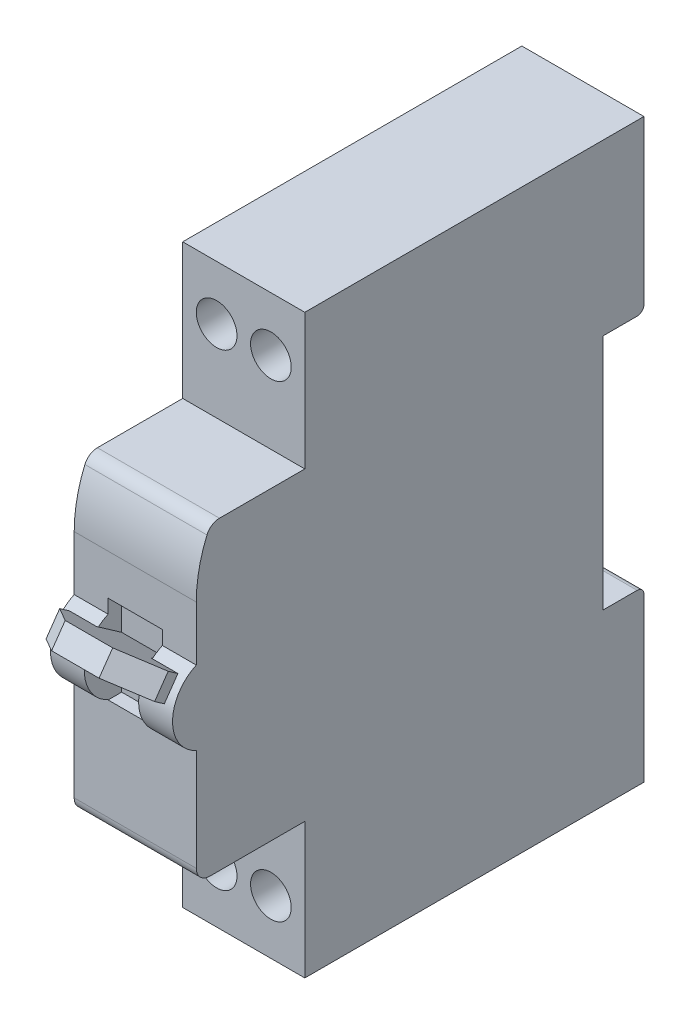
ISO-10303-21;
HEADER;
FILE_DESCRIPTION(('STEP AP214'),'2;1');
FILE_NAME('part.step','',(''),(''),'','','');
FILE_SCHEMA(('AUTOMOTIVE_DESIGN { 1 0 10303 214 1 1 1 1 }'));
ENDSEC;
DATA;
#1=APPLICATION_CONTEXT('core data for automotive mechanical design processes');
#2=APPLICATION_PROTOCOL_DEFINITION('international standard','automotive_design',2000,#1);
#3=PRODUCT_CONTEXT('',#1,'mechanical');
#4=PRODUCT('Part','Part','',(#3));
#5=PRODUCT_RELATED_PRODUCT_CATEGORY('part','',(#4));
#6=PRODUCT_DEFINITION_FORMATION('','',#4);
#7=PRODUCT_DEFINITION_CONTEXT('part definition',#1,'design');
#8=PRODUCT_DEFINITION('design','',#6,#7);
#9=PRODUCT_DEFINITION_SHAPE('','',#8);
#10=(LENGTH_UNIT() NAMED_UNIT(*) SI_UNIT(.MILLI.,.METRE.));
#11=(NAMED_UNIT(*) PLANE_ANGLE_UNIT() SI_UNIT($,.RADIAN.));
#12=(NAMED_UNIT(*) SI_UNIT($,.STERADIAN.) SOLID_ANGLE_UNIT());
#13=UNCERTAINTY_MEASURE_WITH_UNIT(LENGTH_MEASURE(1.E-05),#10,'distance_accuracy_value','');
#14=(GEOMETRIC_REPRESENTATION_CONTEXT(3) GLOBAL_UNCERTAINTY_ASSIGNED_CONTEXT((#13)) GLOBAL_UNIT_ASSIGNED_CONTEXT((#10,
#11,#12)) REPRESENTATION_CONTEXT('',''));
#15=CARTESIAN_POINT('',(0.,0.,0.));
#16=DIRECTION('',(0.,0.,1.));
#17=DIRECTION('',(1.,0.,0.));
#18=AXIS2_PLACEMENT_3D('',#15,#16,#17);
#19=CARTESIAN_POINT('',(-13.,1.,63.));
#20=DIRECTION('',(-1.,0.,0.));
#21=DIRECTION('',(0.,0.,1.));
#22=AXIS2_PLACEMENT_3D('',#19,#20,#21);
#23=PLANE('',#22);
#24=DIRECTION('',(0.,-0.573576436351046,-0.819152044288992));
#25=VECTOR('',#24,1.);
#26=CARTESIAN_POINT('',(-13.,1.86454843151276,63.713883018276));
#27=LINE('',#26,#25);
#28=CARTESIAN_POINT('',(-13.,1.56866142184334,63.2913125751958));
#29=VERTEX_POINT('',#28);
#30=CARTESIAN_POINT('',(-13.,-2.13635553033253,58.));
#31=VERTEX_POINT('',#30);
#32=EDGE_CURVE('E337',#29,#31,#27,.T.);
#33=ORIENTED_EDGE('',*,*,#32,.F.);
#34=CARTESIAN_POINT('',(-13.,0.,57.5));
#35=DIRECTION('',(-1.,0.,0.));
#36=DIRECTION('',(0.,0.,1.));
#37=AXIS2_PLACEMENT_3D('',#34,#35,#36);
#38=CIRCLE('',#37,6.);
#39=CARTESIAN_POINT('',(-13.,-5.45435605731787,60.));
#40=VERTEX_POINT('',#39);
#41=EDGE_CURVE('E419',#40,#29,#38,.T.);
#42=ORIENTED_EDGE('',*,*,#41,.F.);
#43=DIRECTION('',(0.,-1.,0.));
#44=VECTOR('',#43,1.);
#45=CARTESIAN_POINT('',(-13.,-5.45435605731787,60.));
#46=LINE('',#45,#44);
#47=CARTESIAN_POINT('',(-13.,-5.50000000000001,60.));
#48=VERTEX_POINT('',#47);
#49=EDGE_CURVE('E423',#40,#48,#46,.T.);
#50=ORIENTED_EDGE('',*,*,#49,.T.);
#51=DIRECTION('',(0.,0.,-1.));
#52=VECTOR('',#51,1.);
#53=CARTESIAN_POINT('',(-13.,-5.50000000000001,63.));
#54=LINE('',#53,#52);
#55=CARTESIAN_POINT('',(-13.,-5.50000000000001,58.));
#56=VERTEX_POINT('',#55);
#57=EDGE_CURVE('E407',#48,#56,#54,.T.);
#58=ORIENTED_EDGE('',*,*,#57,.T.);
#59=DIRECTION('',(0.,1.,0.));
#60=VECTOR('',#59,1.);
#61=CARTESIAN_POINT('',(-13.,1.,58.));
#62=LINE('',#61,#60);
#63=EDGE_CURVE('E403',#56,#31,#62,.T.);
#64=ORIENTED_EDGE('',*,*,#63,.T.);
#65=EDGE_LOOP('',(#33,#42,#50,#58,#64));
#66=FACE_BOUND('',#65,.T.);
#67=ADVANCED_FACE('F16',(#66),#23,.F.);
#68=CARTESIAN_POINT('',(-5.,1.,58.));
#69=DIRECTION('',(0.,0.,-1.));
#70=DIRECTION('',(-1.,0.,0.));
#71=AXIS2_PLACEMENT_3D('',#68,#69,#70);
#72=PLANE('',#71);
#73=DIRECTION('',(1.,0.,0.));
#74=VECTOR('',#73,1.);
#75=CARTESIAN_POINT('',(-5.,-2.13635553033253,58.));
#76=LINE('',#75,#74);
#77=CARTESIAN_POINT('',(-5.,-2.13635553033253,58.));
#78=VERTEX_POINT('',#77);
#79=EDGE_CURVE('E372',#31,#78,#76,.T.);
#80=ORIENTED_EDGE('',*,*,#79,.F.);
#81=ORIENTED_EDGE('',*,*,#63,.F.);
#82=DIRECTION('',(-1.,0.,0.));
#83=VECTOR('',#82,1.);
#84=CARTESIAN_POINT('',(-5.,-5.50000000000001,58.));
#85=LINE('',#84,#83);
#86=CARTESIAN_POINT('',(-5.,-5.50000000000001,58.));
#87=VERTEX_POINT('',#86);
#88=EDGE_CURVE('E394',#87,#56,#85,.T.);
#89=ORIENTED_EDGE('',*,*,#88,.F.);
#90=DIRECTION('',(0.,-1.,0.));
#91=VECTOR('',#90,1.);
#92=CARTESIAN_POINT('',(-5.,1.,58.));
#93=LINE('',#92,#91);
#94=EDGE_CURVE('E382',#78,#87,#93,.T.);
#95=ORIENTED_EDGE('',*,*,#94,.F.);
#96=EDGE_LOOP('',(#80,#81,#89,#95));
#97=FACE_BOUND('',#96,.T.);
#98=ADVANCED_FACE('F692',(#97),#72,.F.);
#99=CARTESIAN_POINT('',(-5.,1.,63.));
#100=DIRECTION('',(1.,0.,0.));
#101=DIRECTION('',(0.,0.,-1.));
#102=AXIS2_PLACEMENT_3D('',#99,#100,#101);
#103=PLANE('',#102);
#104=DIRECTION('',(0.,0.573576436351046,0.819152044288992));
#105=VECTOR('',#104,1.);
#106=CARTESIAN_POINT('',(-5.,1.2447054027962,62.8286554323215));
#107=LINE('',#106,#105);
#108=CARTESIAN_POINT('',(-5.,1.56866142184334,63.2913125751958));
#109=VERTEX_POINT('',#108);
#110=EDGE_CURVE('E11',#78,#109,#107,.T.);
#111=ORIENTED_EDGE('',*,*,#110,.F.);
#112=ORIENTED_EDGE('',*,*,#94,.T.);
#113=DIRECTION('',(0.,0.,1.));
#114=VECTOR('',#113,1.);
#115=CARTESIAN_POINT('',(-5.,-5.50000000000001,63.));
#116=LINE('',#115,#114);
#117=CARTESIAN_POINT('',(-5.,-5.50000000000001,60.));
#118=VERTEX_POINT('',#117);
#119=EDGE_CURVE('E378',#87,#118,#116,.T.);
#120=ORIENTED_EDGE('',*,*,#119,.T.);
#121=DIRECTION('',(0.,1.,0.));
#122=VECTOR('',#121,1.);
#123=CARTESIAN_POINT('',(-5.,-5.45435605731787,60.));
#124=LINE('',#123,#122);
#125=CARTESIAN_POINT('',(-5.,-5.45435605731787,60.));
#126=VERTEX_POINT('',#125);
#127=EDGE_CURVE('E413',#118,#126,#124,.T.);
#128=ORIENTED_EDGE('',*,*,#127,.T.);
#129=CARTESIAN_POINT('',(-5.,0.,57.5));
#130=DIRECTION('',(1.,0.,0.));
#131=DIRECTION('',(0.,0.,-1.));
#132=AXIS2_PLACEMENT_3D('',#129,#130,#131);
#133=CIRCLE('',#132,6.);
#134=EDGE_CURVE('E410',#109,#126,#133,.T.);
#135=ORIENTED_EDGE('',*,*,#134,.F.);
#136=EDGE_LOOP('',(#111,#112,#120,#128,#135));
#137=FACE_BOUND('',#136,.T.);
#138=ADVANCED_FACE('F699',(#137),#103,.F.);
#139=CARTESIAN_POINT('',(-18.,0.,57.5));
#140=DIRECTION('',(1.,0.,0.));
#141=DIRECTION('',(0.,0.,-1.));
#142=AXIS2_PLACEMENT_3D('',#139,#140,#141);
#143=CYLINDRICAL_SURFACE('',#142,6.);
#144=DIRECTION('',(1.,0.,0.));
#145=VECTOR('',#144,1.);
#146=CARTESIAN_POINT('',(-18.,-5.45435605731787,60.));
#147=LINE('',#146,#145);
#148=CARTESIAN_POINT('',(-18.,-5.45435605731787,60.));
#149=VERTEX_POINT('',#148);
#150=EDGE_CURVE('E585',#149,#40,#147,.T.);
#151=ORIENTED_EDGE('',*,*,#150,.T.);
#152=ORIENTED_EDGE('',*,*,#41,.T.);
#153=CARTESIAN_POINT('',(-13.,0.,57.5));
#154=DIRECTION('',(1.,0.,0.));
#155=DIRECTION('',(0.,1.,0.));
#156=AXIS2_PLACEMENT_3D('',#153,#154,#155);
#157=CIRCLE('',#156,6.);
#158=CARTESIAN_POINT('',(-13.,4.53614796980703,61.4272587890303));
#159=VERTEX_POINT('',#158);
#160=EDGE_CURVE('E375',#159,#29,#157,.T.);
#161=ORIENTED_EDGE('',*,*,#160,.F.);
#162=CARTESIAN_POINT('',(-13.,5.45435605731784,60.));
#163=VERTEX_POINT('',#162);
#164=EDGE_CURVE('E418',#159,#163,#38,.T.);
#165=ORIENTED_EDGE('',*,*,#164,.T.);
#166=DIRECTION('',(1.,0.,0.));
#167=VECTOR('',#166,1.);
#168=CARTESIAN_POINT('',(-18.,5.45435605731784,60.));
#169=LINE('',#168,#167);
#170=CARTESIAN_POINT('',(-18.,5.45435605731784,60.));
#171=VERTEX_POINT('',#170);
#172=EDGE_CURVE('E590',#171,#163,#169,.T.);
#173=ORIENTED_EDGE('',*,*,#172,.F.);
#174=CARTESIAN_POINT('',(-18.,0.,57.5));
#175=DIRECTION('',(-1.,0.,0.));
#176=DIRECTION('',(0.,0.,1.));
#177=AXIS2_PLACEMENT_3D('',#174,#175,#176);
#178=CIRCLE('',#177,6.);
#179=EDGE_CURVE('E530',#149,#171,#178,.T.);
#180=ORIENTED_EDGE('',*,*,#179,.F.);
#181=EDGE_LOOP('',(#151,#152,#161,#165,#173,#180));
#182=FACE_BOUND('',#181,.T.);
#183=ADVANCED_FACE('F725',(#182),#143,.T.);
#184=CARTESIAN_POINT('',(-18.,-17.5,0.));
#185=DIRECTION('',(0.,-1.,0.));
#186=DIRECTION('',(0.,0.,1.));
#187=AXIS2_PLACEMENT_3D('',#184,#185,#186);
#188=PLANE('',#187);
#189=DIRECTION('',(0.,0.,-1.));
#190=VECTOR('',#189,1.);
#191=CARTESIAN_POINT('',(0.,-17.5,0.));
#192=LINE('',#191,#190);
#193=CARTESIAN_POINT('',(0.,-17.5,0.));
#194=VERTEX_POINT('',#193);
#195=CARTESIAN_POINT('',(0.,-17.5,-5.));
#196=VERTEX_POINT('',#195);
#197=EDGE_CURVE('E426',#194,#196,#192,.T.);
#198=ORIENTED_EDGE('',*,*,#197,.T.);
#199=DIRECTION('',(1.,0.,0.));
#200=VECTOR('',#199,1.);
#201=CARTESIAN_POINT('',(-18.,-17.5,-5.));
#202=LINE('',#201,#200);
#203=CARTESIAN_POINT('',(-18.,-17.5,-5.));
#204=VERTEX_POINT('',#203);
#205=EDGE_CURVE('E559',#204,#196,#202,.T.);
#206=ORIENTED_EDGE('',*,*,#205,.F.);
#207=DIRECTION('',(0.,0.,-1.));
#208=VECTOR('',#207,1.);
#209=CARTESIAN_POINT('',(-18.,-17.5,0.));
#210=LINE('',#209,#208);
#211=CARTESIAN_POINT('',(-18.,-17.5,0.));
#212=VERTEX_POINT('',#211);
#213=EDGE_CURVE('E430',#212,#204,#210,.T.);
#214=ORIENTED_EDGE('',*,*,#213,.F.);
#215=DIRECTION('',(1.,0.,0.));
#216=VECTOR('',#215,1.);
#217=CARTESIAN_POINT('',(-18.,-17.5,0.));
#218=LINE('',#217,#216);
#219=EDGE_CURVE('E498',#212,#194,#218,.T.);
#220=ORIENTED_EDGE('',*,*,#219,.T.);
#221=EDGE_LOOP('',(#198,#206,#214,#220));
#222=FACE_BOUND('',#221,.T.);
#223=ADVANCED_FACE('F18',(#222),#188,.F.);
#224=CARTESIAN_POINT('',(-18.,-18.5,-5.));
#225=DIRECTION('',(1.,0.,0.));
#226=DIRECTION('',(0.,0.,-1.));
#227=AXIS2_PLACEMENT_3D('',#224,#225,#226);
#228=CYLINDRICAL_SURFACE('',#227,1.);
#229=CARTESIAN_POINT('',(0.,-18.5,-5.));
#230=DIRECTION('',(-1.,0.,0.));
#231=DIRECTION('',(0.,0.,1.));
#232=AXIS2_PLACEMENT_3D('',#229,#230,#231);
#233=CIRCLE('',#232,1.);
#234=CARTESIAN_POINT('',(0.,-18.5,-6.));
#235=VERTEX_POINT('',#234);
#236=EDGE_CURVE('E489',#196,#235,#233,.T.);
#237=ORIENTED_EDGE('',*,*,#236,.T.);
#238=DIRECTION('',(1.,0.,0.));
#239=VECTOR('',#238,1.);
#240=CARTESIAN_POINT('',(-18.,-18.5,-6.));
#241=LINE('',#240,#239);
#242=CARTESIAN_POINT('',(-18.,-18.5,-6.));
#243=VERTEX_POINT('',#242);
#244=EDGE_CURVE('E564',#243,#235,#241,.T.);
#245=ORIENTED_EDGE('',*,*,#244,.F.);
#246=CARTESIAN_POINT('',(-18.,-18.5,-5.));
#247=DIRECTION('',(-1.,0.,0.));
#248=DIRECTION('',(0.,0.,1.));
#249=AXIS2_PLACEMENT_3D('',#246,#247,#248);
#250=CIRCLE('',#249,1.);
#251=EDGE_CURVE('E553',#204,#243,#250,.T.);
#252=ORIENTED_EDGE('',*,*,#251,.F.);
#253=ORIENTED_EDGE('',*,*,#205,.T.);
#254=EDGE_LOOP('',(#237,#245,#252,#253));
#255=FACE_BOUND('',#254,.T.);
#256=ADVANCED_FACE('F793',(#255),#228,.T.);
#257=CARTESIAN_POINT('',(-18.,-18.5,-6.));
#258=DIRECTION('',(0.,0.,1.));
#259=DIRECTION('',(1.,0.,0.));
#260=AXIS2_PLACEMENT_3D('',#257,#258,#259);
#261=PLANE('',#260);
#262=DIRECTION('',(0.,-1.,0.));
#263=VECTOR('',#262,1.);
#264=CARTESIAN_POINT('',(0.,-18.5,-6.));
#265=LINE('',#264,#263);
#266=CARTESIAN_POINT('',(0.,-42.5,-6.));
#267=VERTEX_POINT('',#266);
#268=EDGE_CURVE('E486',#235,#267,#265,.T.);
#269=ORIENTED_EDGE('',*,*,#268,.T.);
#270=DIRECTION('',(1.,0.,0.));
#271=VECTOR('',#270,1.);
#272=CARTESIAN_POINT('',(-18.,-42.5,-6.));
#273=LINE('',#272,#271);
#274=CARTESIAN_POINT('',(-18.,-42.5,-6.));
#275=VERTEX_POINT('',#274);
#276=EDGE_CURVE('E568',#275,#267,#273,.T.);
#277=ORIENTED_EDGE('',*,*,#276,.F.);
#278=DIRECTION('',(0.,-1.,0.));
#279=VECTOR('',#278,1.);
#280=CARTESIAN_POINT('',(-18.,-18.5,-6.));
#281=LINE('',#280,#279);
#282=EDGE_CURVE('E550',#243,#275,#281,.T.);
#283=ORIENTED_EDGE('',*,*,#282,.F.);
#284=ORIENTED_EDGE('',*,*,#244,.T.);
#285=EDGE_LOOP('',(#269,#277,#283,#284));
#286=FACE_BOUND('',#285,.T.);
#287=ADVANCED_FACE('F806',(#286),#261,.F.);
#288=CARTESIAN_POINT('',(-18.,-42.5,-6.));
#289=DIRECTION('',(0.,1.,0.));
#290=DIRECTION('',(-1.,0.,0.));
#291=AXIS2_PLACEMENT_3D('',#288,#289,#290);
#292=PLANE('',#291);
#293=DIRECTION('',(0.,0.,1.));
#294=VECTOR('',#293,1.);
#295=CARTESIAN_POINT('',(0.,-42.5,-6.));
#296=LINE('',#295,#294);
#297=CARTESIAN_POINT('',(0.,-42.5,44.));
#298=VERTEX_POINT('',#297);
#299=EDGE_CURVE('E482',#267,#298,#296,.T.);
#300=ORIENTED_EDGE('',*,*,#299,.T.);
#301=DIRECTION('',(1.,0.,0.));
#302=VECTOR('',#301,1.);
#303=CARTESIAN_POINT('',(-18.,-42.5,44.));
#304=LINE('',#303,#302);
#305=CARTESIAN_POINT('',(-18.,-42.5,44.));
#306=VERTEX_POINT('',#305);
#307=EDGE_CURVE('E572',#306,#298,#304,.T.);
#308=ORIENTED_EDGE('',*,*,#307,.F.);
#309=DIRECTION('',(0.,0.,1.));
#310=VECTOR('',#309,1.);
#311=CARTESIAN_POINT('',(-18.,-42.5,-6.));
#312=LINE('',#311,#310);
#313=EDGE_CURVE('E547',#275,#306,#312,.T.);
#314=ORIENTED_EDGE('',*,*,#313,.F.);
#315=ORIENTED_EDGE('',*,*,#276,.T.);
#316=EDGE_LOOP('',(#300,#308,#314,#315));
#317=FACE_BOUND('',#316,.T.);
#318=ADVANCED_FACE('F818',(#317),#292,.F.);
#319=CARTESIAN_POINT('',(-18.,-22.5,44.));
#320=DIRECTION('',(0.,0.,1.));
#321=DIRECTION('',(1.,0.,0.));
#322=AXIS2_PLACEMENT_3D('',#319,#320,#321);
#323=PLANE('',#322);
#324=CARTESIAN_POINT('',(-13.,-34.5,44.));
#325=DIRECTION('',(0.,0.,1.));
#326=DIRECTION('',(1.,0.,0.));
#327=AXIS2_PLACEMENT_3D('',#324,#325,#326);
#328=CIRCLE('',#327,3.);
#329=CARTESIAN_POINT('',(-10.,-34.5,44.));
#330=VERTEX_POINT('',#329);
#331=EDGE_CURVE('E646',#330,#330,#328,.T.);
#332=ORIENTED_EDGE('',*,*,#331,.F.);
#333=EDGE_LOOP('',(#332));
#334=FACE_BOUND('',#333,.T.);
#335=CARTESIAN_POINT('',(-5.,-34.5,44.));
#336=DIRECTION('',(0.,0.,1.));
#337=DIRECTION('',(1.,0.,0.));
#338=AXIS2_PLACEMENT_3D('',#335,#336,#337);
#339=CIRCLE('',#338,3.);
#340=CARTESIAN_POINT('',(-2.,-34.5,44.));
#341=VERTEX_POINT('',#340);
#342=EDGE_CURVE('E320',#341,#341,#339,.T.);
#343=ORIENTED_EDGE('',*,*,#342,.F.);
#344=EDGE_LOOP('',(#343));
#345=FACE_BOUND('',#344,.T.);
#346=DIRECTION('',(0.,-1.,0.));
#347=VECTOR('',#346,1.);
#348=CARTESIAN_POINT('',(0.,-22.5,44.));
#349=LINE('',#348,#347);
#350=CARTESIAN_POINT('',(0.,-22.5,44.));
#351=VERTEX_POINT('',#350);
#352=EDGE_CURVE('E478',#351,#298,#349,.T.);
#353=ORIENTED_EDGE('',*,*,#352,.F.);
#354=DIRECTION('',(1.,0.,0.));
#355=VECTOR('',#354,1.);
#356=CARTESIAN_POINT('',(-18.,-22.5,44.));
#357=LINE('',#356,#355);
#358=CARTESIAN_POINT('',(-18.,-22.5,44.));
#359=VERTEX_POINT('',#358);
#360=EDGE_CURVE('E575',#359,#351,#357,.T.);
#361=ORIENTED_EDGE('',*,*,#360,.F.);
#362=DIRECTION('',(0.,-1.,0.));
#363=VECTOR('',#362,1.);
#364=CARTESIAN_POINT('',(-18.,-22.5,44.));
#365=LINE('',#364,#363);
#366=EDGE_CURVE('E543',#359,#306,#365,.T.);
#367=ORIENTED_EDGE('',*,*,#366,.T.);
#368=ORIENTED_EDGE('',*,*,#307,.T.);
#369=EDGE_LOOP('',(#353,#361,#367,#368));
#370=FACE_BOUND('',#369,.T.);
#371=ADVANCED_FACE('F831',(#334,#345,#370),#323,.T.);
#372=CARTESIAN_POINT('',(-18.,-22.5,44.));
#373=DIRECTION('',(0.,1.,0.));
#374=DIRECTION('',(0.,0.,-1.));
#375=AXIS2_PLACEMENT_3D('',#372,#373,#374);
#376=PLANE('',#375);
#377=DIRECTION('',(0.,0.,1.));
#378=VECTOR('',#377,1.);
#379=CARTESIAN_POINT('',(0.,-22.5,44.));
#380=LINE('',#379,#378);
#381=CARTESIAN_POINT('',(0.,-22.5,58.));
#382=VERTEX_POINT('',#381);
#383=EDGE_CURVE('E475',#351,#382,#380,.T.);
#384=ORIENTED_EDGE('',*,*,#383,.T.);
#385=DIRECTION('',(1.,0.,0.));
#386=VECTOR('',#385,1.);
#387=CARTESIAN_POINT('',(-18.,-22.5,58.));
#388=LINE('',#387,#386);
#389=CARTESIAN_POINT('',(-18.,-22.5,58.));
#390=VERTEX_POINT('',#389);
#391=EDGE_CURVE('E578',#390,#382,#388,.T.);
#392=ORIENTED_EDGE('',*,*,#391,.F.);
#393=DIRECTION('',(0.,0.,1.));
#394=VECTOR('',#393,1.);
#395=CARTESIAN_POINT('',(-18.,-22.5,44.));
#396=LINE('',#395,#394);
#397=EDGE_CURVE('E540',#359,#390,#396,.T.);
#398=ORIENTED_EDGE('',*,*,#397,.F.);
#399=ORIENTED_EDGE('',*,*,#360,.T.);
#400=EDGE_LOOP('',(#384,#392,#398,#399));
#401=FACE_BOUND('',#400,.T.);
#402=ADVANCED_FACE('F844',(#401),#376,.F.);
#403=CARTESIAN_POINT('',(-18.,-20.5,58.));
#404=DIRECTION('',(1.,0.,0.));
#405=DIRECTION('',(0.,0.,-1.));
#406=AXIS2_PLACEMENT_3D('',#403,#404,#405);
#407=CYLINDRICAL_SURFACE('',#406,2.);
#408=CARTESIAN_POINT('',(0.,-20.5,58.));
#409=DIRECTION('',(-1.,0.,0.));
#410=DIRECTION('',(0.,0.,1.));
#411=AXIS2_PLACEMENT_3D('',#408,#409,#410);
#412=CIRCLE('',#411,2.);
#413=CARTESIAN_POINT('',(0.,-20.5,60.));
#414=VERTEX_POINT('',#413);
#415=EDGE_CURVE('E471',#382,#414,#412,.T.);
#416=ORIENTED_EDGE('',*,*,#415,.T.);
#417=DIRECTION('',(1.,0.,0.));
#418=VECTOR('',#417,1.);
#419=CARTESIAN_POINT('',(-18.,-20.5,60.));
#420=LINE('',#419,#418);
#421=CARTESIAN_POINT('',(-18.,-20.5,60.));
#422=VERTEX_POINT('',#421);
#423=EDGE_CURVE('E582',#422,#414,#420,.T.);
#424=ORIENTED_EDGE('',*,*,#423,.F.);
#425=CARTESIAN_POINT('',(-18.,-20.5,58.));
#426=DIRECTION('',(-1.,0.,0.));
#427=DIRECTION('',(0.,0.,1.));
#428=AXIS2_PLACEMENT_3D('',#425,#426,#427);
#429=CIRCLE('',#428,2.);
#430=EDGE_CURVE('E537',#390,#422,#429,.T.);
#431=ORIENTED_EDGE('',*,*,#430,.F.);
#432=ORIENTED_EDGE('',*,*,#391,.T.);
#433=EDGE_LOOP('',(#416,#424,#431,#432));
#434=FACE_BOUND('',#433,.T.);
#435=ADVANCED_FACE('F859',(#434),#407,.T.);
#436=CARTESIAN_POINT('',(-18.,-5.45435605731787,60.));
#437=DIRECTION('',(0.,0.,1.));
#438=DIRECTION('',(1.,0.,0.));
#439=AXIS2_PLACEMENT_3D('',#436,#437,#438);
#440=PLANE('',#439);
#441=ORIENTED_EDGE('',*,*,#49,.F.);
#442=ORIENTED_EDGE('',*,*,#150,.F.);
#443=DIRECTION('',(0.,-1.,0.));
#444=VECTOR('',#443,1.);
#445=CARTESIAN_POINT('',(-18.,-5.45435605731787,60.));
#446=LINE('',#445,#444);
#447=EDGE_CURVE('E533',#149,#422,#446,.T.);
#448=ORIENTED_EDGE('',*,*,#447,.T.);
#449=ORIENTED_EDGE('',*,*,#423,.T.);
#450=DIRECTION('',(0.,-1.,0.));
#451=VECTOR('',#450,1.);
#452=CARTESIAN_POINT('',(0.,-5.45435605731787,60.));
#453=LINE('',#452,#451);
#454=CARTESIAN_POINT('',(0.,-5.45435605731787,60.));
#455=VERTEX_POINT('',#454);
#456=EDGE_CURVE('E467',#455,#414,#453,.T.);
#457=ORIENTED_EDGE('',*,*,#456,.F.);
#458=EDGE_CURVE('E589',#126,#455,#147,.T.);
#459=ORIENTED_EDGE('',*,*,#458,.F.);
#460=ORIENTED_EDGE('',*,*,#127,.F.);
#461=DIRECTION('',(1.,0.,0.));
#462=VECTOR('',#461,1.);
#463=CARTESIAN_POINT('',(-18.,-5.50000000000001,60.));
#464=LINE('',#463,#462);
#465=EDGE_CURVE('E638',#48,#118,#464,.T.);
#466=ORIENTED_EDGE('',*,*,#465,.F.);
#467=EDGE_LOOP('',(#441,#442,#448,#449,#457,#459,#460,#466));
#468=FACE_BOUND('',#467,.T.);
#469=ADVANCED_FACE('F872',(#468),#440,.T.);
#470=CARTESIAN_POINT('',(-5.,5.45435605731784,60.));
#471=VERTEX_POINT('',#470);
#472=CARTESIAN_POINT('',(0.,5.45435605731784,60.));
#473=VERTEX_POINT('',#472);
#474=EDGE_CURVE('E594',#471,#473,#169,.T.);
#475=ORIENTED_EDGE('',*,*,#474,.F.);
#476=CARTESIAN_POINT('',(-5.,4.53614796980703,61.4272587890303));
#477=VERTEX_POINT('',#476);
#478=EDGE_CURVE('E42',#471,#477,#133,.T.);
#479=ORIENTED_EDGE('',*,*,#478,.T.);
#480=EDGE_CURVE('E414',#477,#109,#133,.T.);
#481=ORIENTED_EDGE('',*,*,#480,.T.);
#482=ORIENTED_EDGE('',*,*,#134,.T.);
#483=ORIENTED_EDGE('',*,*,#458,.T.);
#484=CARTESIAN_POINT('',(0.,0.,57.5));
#485=DIRECTION('',(-1.,0.,0.));
#486=DIRECTION('',(0.,0.,1.));
#487=AXIS2_PLACEMENT_3D('',#484,#485,#486);
#488=CIRCLE('',#487,6.);
#489=EDGE_CURVE('E463',#455,#473,#488,.T.);
#490=ORIENTED_EDGE('',*,*,#489,.T.);
#491=EDGE_LOOP('',(#475,#479,#481,#482,#483,#490));
#492=FACE_BOUND('',#491,.T.);
#493=ADVANCED_FACE('F780',(#492),#143,.T.);
#494=CARTESIAN_POINT('',(-18.,13.5,60.));
#495=DIRECTION('',(0.,0.,1.));
#496=DIRECTION('',(0.,1.,0.));
#497=AXIS2_PLACEMENT_3D('',#494,#495,#496);
#498=PLANE('',#497);
#499=DIRECTION('',(0.,-1.,0.));
#500=VECTOR('',#499,1.);
#501=CARTESIAN_POINT('',(-13.,13.5,60.));
#502=LINE('',#501,#500);
#503=CARTESIAN_POINT('',(-13.,7.50000000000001,60.));
#504=VERTEX_POINT('',#503);
#505=EDGE_CURVE('E634',#504,#163,#502,.T.);
#506=ORIENTED_EDGE('',*,*,#505,.F.);
#507=DIRECTION('',(-1.,0.,0.));
#508=VECTOR('',#507,1.);
#509=CARTESIAN_POINT('',(-18.,7.50000000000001,60.));
#510=LINE('',#509,#508);
#511=CARTESIAN_POINT('',(-5.,7.50000000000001,60.));
#512=VERTEX_POINT('',#511);
#513=EDGE_CURVE('E631',#512,#504,#510,.T.);
#514=ORIENTED_EDGE('',*,*,#513,.F.);
#515=DIRECTION('',(0.,1.,0.));
#516=VECTOR('',#515,1.);
#517=CARTESIAN_POINT('',(-5.,13.5,60.));
#518=LINE('',#517,#516);
#519=EDGE_CURVE('E563',#471,#512,#518,.T.);
#520=ORIENTED_EDGE('',*,*,#519,.F.);
#521=ORIENTED_EDGE('',*,*,#474,.T.);
#522=DIRECTION('',(0.,-1.,0.));
#523=VECTOR('',#522,1.);
#524=CARTESIAN_POINT('',(0.,13.5,60.));
#525=LINE('',#524,#523);
#526=CARTESIAN_POINT('',(0.,13.5,60.));
#527=VERTEX_POINT('',#526);
#528=EDGE_CURVE('E459',#527,#473,#525,.T.);
#529=ORIENTED_EDGE('',*,*,#528,.F.);
#530=DIRECTION('',(1.,0.,0.));
#531=VECTOR('',#530,1.);
#532=CARTESIAN_POINT('',(-18.,13.5,60.));
#533=LINE('',#532,#531);
#534=CARTESIAN_POINT('',(-18.,13.5,60.));
#535=VERTEX_POINT('',#534);
#536=EDGE_CURVE('E595',#535,#527,#533,.T.);
#537=ORIENTED_EDGE('',*,*,#536,.F.);
#538=DIRECTION('',(0.,-1.,0.));
#539=VECTOR('',#538,1.);
#540=CARTESIAN_POINT('',(-18.,13.5,60.));
#541=LINE('',#540,#539);
#542=EDGE_CURVE('E526',#535,#171,#541,.T.);
#543=ORIENTED_EDGE('',*,*,#542,.T.);
#544=ORIENTED_EDGE('',*,*,#172,.T.);
#545=EDGE_LOOP('',(#506,#514,#520,#521,#529,#537,#543,#544));
#546=FACE_BOUND('',#545,.T.);
#547=ADVANCED_FACE('F900',(#546),#498,.T.);
#548=CARTESIAN_POINT('',(-18.,13.5,40.));
#549=DIRECTION('',(1.,0.,0.));
#550=DIRECTION('',(0.,0.,-1.));
#551=AXIS2_PLACEMENT_3D('',#548,#549,#550);
#552=CYLINDRICAL_SURFACE('',#551,20.);
#553=CARTESIAN_POINT('',(0.,13.5,40.));
#554=DIRECTION('',(-1.,0.,0.));
#555=DIRECTION('',(0.,0.,1.));
#556=AXIS2_PLACEMENT_3D('',#553,#554,#555);
#557=CIRCLE('',#556,20.);
#558=CARTESIAN_POINT('',(0.,21.2777777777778,58.4256932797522));
#559=VERTEX_POINT('',#558);
#560=EDGE_CURVE('E456',#527,#559,#557,.T.);
#561=ORIENTED_EDGE('',*,*,#560,.T.);
#562=DIRECTION('',(1.,0.,0.));
#563=VECTOR('',#562,1.);
#564=CARTESIAN_POINT('',(-18.,21.2777777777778,58.4256932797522));
#565=LINE('',#564,#563);
#566=CARTESIAN_POINT('',(-18.,21.2777777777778,58.4256932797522));
#567=VERTEX_POINT('',#566);
#568=EDGE_CURVE('E598',#567,#559,#565,.T.);
#569=ORIENTED_EDGE('',*,*,#568,.F.);
#570=CARTESIAN_POINT('',(-18.,13.5,40.));
#571=DIRECTION('',(-1.,0.,0.));
#572=DIRECTION('',(0.,0.,1.));
#573=AXIS2_PLACEMENT_3D('',#570,#571,#572);
#574=CIRCLE('',#573,20.);
#575=EDGE_CURVE('E523',#535,#567,#574,.T.);
#576=ORIENTED_EDGE('',*,*,#575,.F.);
#577=ORIENTED_EDGE('',*,*,#536,.T.);
#578=EDGE_LOOP('',(#561,#569,#576,#577));
#579=FACE_BOUND('',#578,.T.);
#580=ADVANCED_FACE('F915',(#579),#552,.T.);
#581=CARTESIAN_POINT('',(-18.,20.5,56.583123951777));
#582=DIRECTION('',(1.,0.,0.));
#583=DIRECTION('',(0.,0.,-1.));
#584=AXIS2_PLACEMENT_3D('',#581,#582,#583);
#585=CYLINDRICAL_SURFACE('',#584,2.);
#586=CARTESIAN_POINT('',(0.,20.5,56.583123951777));
#587=DIRECTION('',(-1.,0.,0.));
#588=DIRECTION('',(0.,0.,1.));
#589=AXIS2_PLACEMENT_3D('',#586,#587,#588);
#590=CIRCLE('',#589,2.);
#591=CARTESIAN_POINT('',(0.,22.5,56.583123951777));
#592=VERTEX_POINT('',#591);
#593=EDGE_CURVE('E452',#559,#592,#590,.T.);
#594=ORIENTED_EDGE('',*,*,#593,.T.);
#595=DIRECTION('',(1.,0.,0.));
#596=VECTOR('',#595,1.);
#597=CARTESIAN_POINT('',(-18.,22.5,56.583123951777));
#598=LINE('',#597,#596);
#599=CARTESIAN_POINT('',(-18.,22.5,56.583123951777));
#600=VERTEX_POINT('',#599);
#601=EDGE_CURVE('E602',#600,#592,#598,.T.);
#602=ORIENTED_EDGE('',*,*,#601,.F.);
#603=CARTESIAN_POINT('',(-18.,20.5,56.583123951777));
#604=DIRECTION('',(-1.,0.,0.));
#605=DIRECTION('',(0.,0.,1.));
#606=AXIS2_PLACEMENT_3D('',#603,#604,#605);
#607=CIRCLE('',#606,2.);
#608=EDGE_CURVE('E520',#567,#600,#607,.T.);
#609=ORIENTED_EDGE('',*,*,#608,.F.);
#610=ORIENTED_EDGE('',*,*,#568,.T.);
#611=EDGE_LOOP('',(#594,#602,#609,#610));
#612=FACE_BOUND('',#611,.T.);
#613=ADVANCED_FACE('F931',(#612),#585,.T.);
#614=CARTESIAN_POINT('',(-18.,22.5,44.));
#615=DIRECTION('',(0.,1.,0.));
#616=DIRECTION('',(-1.,0.,0.));
#617=AXIS2_PLACEMENT_3D('',#614,#615,#616);
#618=PLANE('',#617);
#619=DIRECTION('',(0.,0.,1.));
#620=VECTOR('',#619,1.);
#621=CARTESIAN_POINT('',(0.,22.5,44.));
#622=LINE('',#621,#620);
#623=CARTESIAN_POINT('',(0.,22.5,44.));
#624=VERTEX_POINT('',#623);
#625=EDGE_CURVE('E448',#624,#592,#622,.T.);
#626=ORIENTED_EDGE('',*,*,#625,.F.);
#627=DIRECTION('',(1.,0.,0.));
#628=VECTOR('',#627,1.);
#629=CARTESIAN_POINT('',(-18.,22.5,44.));
#630=LINE('',#629,#628);
#631=CARTESIAN_POINT('',(-18.,22.5,44.));
#632=VERTEX_POINT('',#631);
#633=EDGE_CURVE('E605',#632,#624,#630,.T.);
#634=ORIENTED_EDGE('',*,*,#633,.F.);
#635=DIRECTION('',(0.,0.,1.));
#636=VECTOR('',#635,1.);
#637=CARTESIAN_POINT('',(-18.,22.5,44.));
#638=LINE('',#637,#636);
#639=EDGE_CURVE('E516',#632,#600,#638,.T.);
#640=ORIENTED_EDGE('',*,*,#639,.T.);
#641=ORIENTED_EDGE('',*,*,#601,.T.);
#642=EDGE_LOOP('',(#626,#634,#640,#641));
#643=FACE_BOUND('',#642,.T.);
#644=ADVANCED_FACE('F944',(#643),#618,.T.);
#645=CARTESIAN_POINT('',(-18.,42.5,44.));
#646=DIRECTION('',(0.,0.,1.));
#647=DIRECTION('',(1.,0.,0.));
#648=AXIS2_PLACEMENT_3D('',#645,#646,#647);
#649=PLANE('',#648);
#650=CARTESIAN_POINT('',(-13.,34.5,44.));
#651=DIRECTION('',(0.,0.,1.));
#652=DIRECTION('',(1.,0.,0.));
#653=AXIS2_PLACEMENT_3D('',#650,#651,#652);
#654=CIRCLE('',#653,3.);
#655=CARTESIAN_POINT('',(-10.,34.5,44.));
#656=VERTEX_POINT('',#655);
#657=EDGE_CURVE('E20',#656,#656,#654,.T.);
#658=ORIENTED_EDGE('',*,*,#657,.F.);
#659=EDGE_LOOP('',(#658));
#660=FACE_BOUND('',#659,.T.);
#661=CARTESIAN_POINT('',(-5.,34.5,44.));
#662=DIRECTION('',(0.,0.,1.));
#663=DIRECTION('',(1.,0.,0.));
#664=AXIS2_PLACEMENT_3D('',#661,#662,#663);
#665=CIRCLE('',#664,3.);
#666=CARTESIAN_POINT('',(-2.,34.5,44.));
#667=VERTEX_POINT('',#666);
#668=EDGE_CURVE('E650',#667,#667,#665,.T.);
#669=ORIENTED_EDGE('',*,*,#668,.F.);
#670=EDGE_LOOP('',(#669));
#671=FACE_BOUND('',#670,.T.);
#672=DIRECTION('',(0.,-1.,0.));
#673=VECTOR('',#672,1.);
#674=CARTESIAN_POINT('',(0.,42.5,44.));
#675=LINE('',#674,#673);
#676=CARTESIAN_POINT('',(0.,42.5,44.));
#677=VERTEX_POINT('',#676);
#678=EDGE_CURVE('E444',#677,#624,#675,.T.);
#679=ORIENTED_EDGE('',*,*,#678,.F.);
#680=DIRECTION('',(1.,0.,0.));
#681=VECTOR('',#680,1.);
#682=CARTESIAN_POINT('',(-18.,42.5,44.));
#683=LINE('',#682,#681);
#684=CARTESIAN_POINT('',(-18.,42.5,44.));
#685=VERTEX_POINT('',#684);
#686=EDGE_CURVE('E608',#685,#677,#683,.T.);
#687=ORIENTED_EDGE('',*,*,#686,.F.);
#688=DIRECTION('',(0.,-1.,0.));
#689=VECTOR('',#688,1.);
#690=CARTESIAN_POINT('',(-18.,42.5,44.));
#691=LINE('',#690,#689);
#692=EDGE_CURVE('E512',#685,#632,#691,.T.);
#693=ORIENTED_EDGE('',*,*,#692,.T.);
#694=ORIENTED_EDGE('',*,*,#633,.T.);
#695=EDGE_LOOP('',(#679,#687,#693,#694));
#696=FACE_BOUND('',#695,.T.);
#697=ADVANCED_FACE('F957',(#660,#671,#696),#649,.T.);
#698=CARTESIAN_POINT('',(-18.,42.5,-6.));
#699=DIRECTION('',(0.,1.,0.));
#700=DIRECTION('',(-1.,0.,0.));
#701=AXIS2_PLACEMENT_3D('',#698,#699,#700);
#702=PLANE('',#701);
#703=DIRECTION('',(0.,0.,1.));
#704=VECTOR('',#703,1.);
#705=CARTESIAN_POINT('',(0.,42.5,-6.));
#706=LINE('',#705,#704);
#707=CARTESIAN_POINT('',(0.,42.5,-6.));
#708=VERTEX_POINT('',#707);
#709=EDGE_CURVE('E440',#708,#677,#706,.T.);
#710=ORIENTED_EDGE('',*,*,#709,.F.);
#711=DIRECTION('',(1.,0.,0.));
#712=VECTOR('',#711,1.);
#713=CARTESIAN_POINT('',(-18.,42.5,-6.));
#714=LINE('',#713,#712);
#715=CARTESIAN_POINT('',(-18.,42.5,-6.));
#716=VERTEX_POINT('',#715);
#717=EDGE_CURVE('E611',#716,#708,#714,.T.);
#718=ORIENTED_EDGE('',*,*,#717,.F.);
#719=DIRECTION('',(0.,0.,1.));
#720=VECTOR('',#719,1.);
#721=CARTESIAN_POINT('',(-18.,42.5,-6.));
#722=LINE('',#721,#720);
#723=EDGE_CURVE('E508',#716,#685,#722,.T.);
#724=ORIENTED_EDGE('',*,*,#723,.T.);
#725=ORIENTED_EDGE('',*,*,#686,.T.);
#726=EDGE_LOOP('',(#710,#718,#724,#725));
#727=FACE_BOUND('',#726,.T.);
#728=ADVANCED_FACE('F970',(#727),#702,.T.);
#729=CARTESIAN_POINT('',(-18.,42.5,-6.));
#730=DIRECTION('',(0.,0.,1.));
#731=DIRECTION('',(1.,0.,0.));
#732=AXIS2_PLACEMENT_3D('',#729,#730,#731);
#733=PLANE('',#732);
#734=DIRECTION('',(0.,-1.,0.));
#735=VECTOR('',#734,1.);
#736=CARTESIAN_POINT('',(0.,42.5,-6.));
#737=LINE('',#736,#735);
#738=CARTESIAN_POINT('',(0.,18.5,-6.));
#739=VERTEX_POINT('',#738);
#740=EDGE_CURVE('E437',#708,#739,#737,.T.);
#741=ORIENTED_EDGE('',*,*,#740,.T.);
#742=DIRECTION('',(1.,0.,0.));
#743=VECTOR('',#742,1.);
#744=CARTESIAN_POINT('',(-18.,18.5,-6.));
#745=LINE('',#744,#743);
#746=CARTESIAN_POINT('',(-18.,18.5,-6.));
#747=VERTEX_POINT('',#746);
#748=EDGE_CURVE('E614',#747,#739,#745,.T.);
#749=ORIENTED_EDGE('',*,*,#748,.F.);
#750=DIRECTION('',(0.,-1.,0.));
#751=VECTOR('',#750,1.);
#752=CARTESIAN_POINT('',(-18.,42.5,-6.));
#753=LINE('',#752,#751);
#754=EDGE_CURVE('E505',#716,#747,#753,.T.);
#755=ORIENTED_EDGE('',*,*,#754,.F.);
#756=ORIENTED_EDGE('',*,*,#717,.T.);
#757=EDGE_LOOP('',(#741,#749,#755,#756));
#758=FACE_BOUND('',#757,.T.);
#759=ADVANCED_FACE('F989',(#758),#733,.F.);
#760=CARTESIAN_POINT('',(-18.,18.5,-5.));
#761=DIRECTION('',(1.,0.,0.));
#762=DIRECTION('',(0.,0.,-1.));
#763=AXIS2_PLACEMENT_3D('',#760,#761,#762);
#764=CYLINDRICAL_SURFACE('',#763,1.);
#765=CARTESIAN_POINT('',(0.,18.5,-5.));
#766=DIRECTION('',(-1.,0.,0.));
#767=DIRECTION('',(0.,0.,1.));
#768=AXIS2_PLACEMENT_3D('',#765,#766,#767);
#769=CIRCLE('',#768,1.);
#770=CARTESIAN_POINT('',(0.,17.5,-5.));
#771=VERTEX_POINT('',#770);
#772=EDGE_CURVE('E434',#739,#771,#769,.T.);
#773=ORIENTED_EDGE('',*,*,#772,.T.);
#774=DIRECTION('',(1.,0.,0.));
#775=VECTOR('',#774,1.);
#776=CARTESIAN_POINT('',(-18.,17.5,-5.));
#777=LINE('',#776,#775);
#778=CARTESIAN_POINT('',(-18.,17.5,-5.));
#779=VERTEX_POINT('',#778);
#780=EDGE_CURVE('E618',#779,#771,#777,.T.);
#781=ORIENTED_EDGE('',*,*,#780,.F.);
#782=CARTESIAN_POINT('',(-18.,18.5,-5.));
#783=DIRECTION('',(-1.,0.,0.));
#784=DIRECTION('',(0.,0.,1.));
#785=AXIS2_PLACEMENT_3D('',#782,#783,#784);
#786=CIRCLE('',#785,1.);
#787=EDGE_CURVE('E502',#747,#779,#786,.T.);
#788=ORIENTED_EDGE('',*,*,#787,.F.);
#789=ORIENTED_EDGE('',*,*,#748,.T.);
#790=EDGE_LOOP('',(#773,#781,#788,#789));
#791=FACE_BOUND('',#790,.T.);
#792=ADVANCED_FACE('F1002',(#791),#764,.T.);
#793=CARTESIAN_POINT('',(-18.,17.5,-5.));
#794=DIRECTION('',(0.,1.,0.));
#795=DIRECTION('',(0.,0.,-1.));
#796=AXIS2_PLACEMENT_3D('',#793,#794,#795);
#797=PLANE('',#796);
#798=DIRECTION('',(0.,0.,1.));
#799=VECTOR('',#798,1.);
#800=CARTESIAN_POINT('',(0.,17.5,-5.));
#801=LINE('',#800,#799);
#802=CARTESIAN_POINT('',(0.,17.5,0.));
#803=VERTEX_POINT('',#802);
#804=EDGE_CURVE('E431',#771,#803,#801,.T.);
#805=ORIENTED_EDGE('',*,*,#804,.T.);
#806=DIRECTION('',(1.,0.,0.));
#807=VECTOR('',#806,1.);
#808=CARTESIAN_POINT('',(-18.,17.5,0.));
#809=LINE('',#808,#807);
#810=CARTESIAN_POINT('',(-18.,17.5,0.));
#811=VERTEX_POINT('',#810);
#812=EDGE_CURVE('E622',#811,#803,#809,.T.);
#813=ORIENTED_EDGE('',*,*,#812,.F.);
#814=DIRECTION('',(0.,0.,1.));
#815=VECTOR('',#814,1.);
#816=CARTESIAN_POINT('',(-18.,17.5,-5.));
#817=LINE('',#816,#815);
#818=EDGE_CURVE('E499',#779,#811,#817,.T.);
#819=ORIENTED_EDGE('',*,*,#818,.F.);
#820=ORIENTED_EDGE('',*,*,#780,.T.);
#821=EDGE_LOOP('',(#805,#813,#819,#820));
#822=FACE_BOUND('',#821,.T.);
#823=ADVANCED_FACE('F1014',(#822),#797,.F.);
#824=CARTESIAN_POINT('',(-18.,17.5,0.));
#825=DIRECTION('',(0.,0.,1.));
#826=DIRECTION('',(1.,0.,0.));
#827=AXIS2_PLACEMENT_3D('',#824,#825,#826);
#828=PLANE('',#827);
#829=DIRECTION('',(0.,-1.,0.));
#830=VECTOR('',#829,1.);
#831=CARTESIAN_POINT('',(0.,17.5,0.));
#832=LINE('',#831,#830);
#833=EDGE_CURVE('E427',#803,#194,#832,.T.);
#834=ORIENTED_EDGE('',*,*,#833,.T.);
#835=ORIENTED_EDGE('',*,*,#219,.F.);
#836=DIRECTION('',(0.,-1.,0.));
#837=VECTOR('',#836,1.);
#838=CARTESIAN_POINT('',(-18.,17.5,0.));
#839=LINE('',#838,#837);
#840=EDGE_CURVE('E495',#811,#212,#839,.T.);
#841=ORIENTED_EDGE('',*,*,#840,.F.);
#842=ORIENTED_EDGE('',*,*,#812,.T.);
#843=EDGE_LOOP('',(#834,#835,#841,#842));
#844=FACE_BOUND('',#843,.T.);
#845=ADVANCED_FACE('F1025',(#844),#828,.F.);
#846=CARTESIAN_POINT('',(-18.,-18.5,-5.));
#847=DIRECTION('',(-1.,0.,0.));
#848=DIRECTION('',(0.,0.,1.));
#849=AXIS2_PLACEMENT_3D('',#846,#847,#848);
#850=PLANE('',#849);
#851=ORIENTED_EDGE('',*,*,#213,.T.);
#852=ORIENTED_EDGE('',*,*,#251,.T.);
#853=ORIENTED_EDGE('',*,*,#282,.T.);
#854=ORIENTED_EDGE('',*,*,#313,.T.);
#855=ORIENTED_EDGE('',*,*,#366,.F.);
#856=ORIENTED_EDGE('',*,*,#397,.T.);
#857=ORIENTED_EDGE('',*,*,#430,.T.);
#858=ORIENTED_EDGE('',*,*,#447,.F.);
#859=ORIENTED_EDGE('',*,*,#179,.T.);
#860=ORIENTED_EDGE('',*,*,#542,.F.);
#861=ORIENTED_EDGE('',*,*,#575,.T.);
#862=ORIENTED_EDGE('',*,*,#608,.T.);
#863=ORIENTED_EDGE('',*,*,#639,.F.);
#864=ORIENTED_EDGE('',*,*,#692,.F.);
#865=ORIENTED_EDGE('',*,*,#723,.F.);
#866=ORIENTED_EDGE('',*,*,#754,.T.);
#867=ORIENTED_EDGE('',*,*,#787,.T.);
#868=ORIENTED_EDGE('',*,*,#818,.T.);
#869=ORIENTED_EDGE('',*,*,#840,.T.);
#870=EDGE_LOOP('',(#851,#852,#853,#854,#855,#856,#857,#858,#859,#860,#861,#862,#863,#864,#865,
#866,#867,#868,#869));
#871=FACE_BOUND('',#870,.T.);
#872=ADVANCED_FACE('F715',(#871),#850,.T.);
#873=CARTESIAN_POINT('',(0.,-18.5,-5.));
#874=DIRECTION('',(-1.,0.,0.));
#875=DIRECTION('',(0.,0.,1.));
#876=AXIS2_PLACEMENT_3D('',#873,#874,#875);
#877=PLANE('',#876);
#878=ORIENTED_EDGE('',*,*,#197,.F.);
#879=ORIENTED_EDGE('',*,*,#833,.F.);
#880=ORIENTED_EDGE('',*,*,#804,.F.);
#881=ORIENTED_EDGE('',*,*,#772,.F.);
#882=ORIENTED_EDGE('',*,*,#740,.F.);
#883=ORIENTED_EDGE('',*,*,#709,.T.);
#884=ORIENTED_EDGE('',*,*,#678,.T.);
#885=ORIENTED_EDGE('',*,*,#625,.T.);
#886=ORIENTED_EDGE('',*,*,#593,.F.);
#887=ORIENTED_EDGE('',*,*,#560,.F.);
#888=ORIENTED_EDGE('',*,*,#528,.T.);
#889=ORIENTED_EDGE('',*,*,#489,.F.);
#890=ORIENTED_EDGE('',*,*,#456,.T.);
#891=ORIENTED_EDGE('',*,*,#415,.F.);
#892=ORIENTED_EDGE('',*,*,#383,.F.);
#893=ORIENTED_EDGE('',*,*,#352,.T.);
#894=ORIENTED_EDGE('',*,*,#299,.F.);
#895=ORIENTED_EDGE('',*,*,#268,.F.);
#896=ORIENTED_EDGE('',*,*,#236,.F.);
#897=EDGE_LOOP('',(#878,#879,#880,#881,#882,#883,#884,#885,#886,#887,#888,#889,#890,#891,#892,
#893,#894,#895,#896));
#898=FACE_BOUND('',#897,.T.);
#899=ADVANCED_FACE('F708',(#898),#877,.F.);
#900=ORIENTED_EDGE('',*,*,#164,.F.);
#901=DIRECTION('',(0.,-0.573576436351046,-0.819152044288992));
#902=VECTOR('',#901,1.);
#903=CARTESIAN_POINT('',(-13.,4.73158058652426,61.7063654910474));
#904=LINE('',#903,#902);
#905=CARTESIAN_POINT('',(-13.,2.13635553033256,58.));
#906=VERTEX_POINT('',#905);
#907=EDGE_CURVE('E307',#159,#906,#904,.T.);
#908=ORIENTED_EDGE('',*,*,#907,.T.);
#909=CARTESIAN_POINT('',(-13.,7.50000000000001,58.));
#910=VERTEX_POINT('',#909);
#911=EDGE_CURVE('E402',#906,#910,#62,.T.);
#912=ORIENTED_EDGE('',*,*,#911,.T.);
#913=DIRECTION('',(0.,0.,1.));
#914=VECTOR('',#913,1.);
#915=CARTESIAN_POINT('',(-13.,7.50000000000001,63.));
#916=LINE('',#915,#914);
#917=EDGE_CURVE('E398',#910,#504,#916,.T.);
#918=ORIENTED_EDGE('',*,*,#917,.T.);
#919=ORIENTED_EDGE('',*,*,#505,.T.);
#920=EDGE_LOOP('',(#900,#908,#912,#918,#919));
#921=FACE_BOUND('',#920,.T.);
#922=ADVANCED_FACE('F695',(#921),#23,.F.);
#923=CARTESIAN_POINT('',(-5.,-5.50000000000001,63.));
#924=DIRECTION('',(0.,-1.,0.));
#925=DIRECTION('',(1.,0.,0.));
#926=AXIS2_PLACEMENT_3D('',#923,#924,#925);
#927=PLANE('',#926);
#928=ORIENTED_EDGE('',*,*,#465,.T.);
#929=ORIENTED_EDGE('',*,*,#119,.F.);
#930=ORIENTED_EDGE('',*,*,#88,.T.);
#931=ORIENTED_EDGE('',*,*,#57,.F.);
#932=EDGE_LOOP('',(#928,#929,#930,#931));
#933=FACE_BOUND('',#932,.T.);
#934=ADVANCED_FACE('F707',(#933),#927,.F.);
#935=ORIENTED_EDGE('',*,*,#911,.F.);
#936=DIRECTION('',(1.,0.,0.));
#937=VECTOR('',#936,1.);
#938=CARTESIAN_POINT('',(-5.,2.13635553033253,58.));
#939=LINE('',#938,#937);
#940=CARTESIAN_POINT('',(-5.,2.13635553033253,58.));
#941=VERTEX_POINT('',#940);
#942=EDGE_CURVE('E367',#906,#941,#939,.T.);
#943=ORIENTED_EDGE('',*,*,#942,.T.);
#944=CARTESIAN_POINT('',(-5.,7.50000000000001,58.));
#945=VERTEX_POINT('',#944);
#946=EDGE_CURVE('E387',#945,#941,#93,.T.);
#947=ORIENTED_EDGE('',*,*,#946,.F.);
#948=DIRECTION('',(-1.,0.,0.));
#949=VECTOR('',#948,1.);
#950=CARTESIAN_POINT('',(-5.,7.50000000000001,58.));
#951=LINE('',#950,#949);
#952=EDGE_CURVE('E386',#945,#910,#951,.T.);
#953=ORIENTED_EDGE('',*,*,#952,.T.);
#954=EDGE_LOOP('',(#935,#943,#947,#953));
#955=FACE_BOUND('',#954,.T.);
#956=ADVANCED_FACE('F702',(#955),#72,.F.);
#957=CARTESIAN_POINT('',(-5.,7.50000000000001,63.));
#958=DIRECTION('',(0.,1.,0.));
#959=DIRECTION('',(-1.,0.,0.));
#960=AXIS2_PLACEMENT_3D('',#957,#958,#959);
#961=PLANE('',#960);
#962=ORIENTED_EDGE('',*,*,#513,.T.);
#963=ORIENTED_EDGE('',*,*,#917,.F.);
#964=ORIENTED_EDGE('',*,*,#952,.F.);
#965=DIRECTION('',(0.,0.,-1.));
#966=VECTOR('',#965,1.);
#967=CARTESIAN_POINT('',(-5.,7.50000000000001,63.));
#968=LINE('',#967,#966);
#969=EDGE_CURVE('E383',#512,#945,#968,.T.);
#970=ORIENTED_EDGE('',*,*,#969,.F.);
#971=EDGE_LOOP('',(#962,#963,#964,#970));
#972=FACE_BOUND('',#971,.T.);
#973=ADVANCED_FACE('F1079',(#972),#961,.F.);
#974=ORIENTED_EDGE('',*,*,#946,.T.);
#975=DIRECTION('',(0.,0.573576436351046,0.819152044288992));
#976=VECTOR('',#975,1.);
#977=CARTESIAN_POINT('',(-5.,4.11173755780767,60.8211379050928));
#978=LINE('',#977,#976);
#979=EDGE_CURVE('E26',#941,#477,#978,.T.);
#980=ORIENTED_EDGE('',*,*,#979,.T.);
#981=ORIENTED_EDGE('',*,*,#478,.F.);
#982=ORIENTED_EDGE('',*,*,#519,.T.);
#983=ORIENTED_EDGE('',*,*,#969,.T.);
#984=EDGE_LOOP('',(#974,#980,#981,#982,#983));
#985=FACE_BOUND('',#984,.T.);
#986=ADVANCED_FACE('F766',(#985),#103,.F.);
#987=CARTESIAN_POINT('',(-13.,1.86454843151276,63.713883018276));
#988=DIRECTION('',(1.,0.,0.));
#989=DIRECTION('',(0.,0.819152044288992,-0.573576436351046));
#990=AXIS2_PLACEMENT_3D('',#987,#988,#989);
#991=PLANE('',#990);
#992=CARTESIAN_POINT('',(-13.,4.73158058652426,61.7063654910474));
#993=VERTEX_POINT('',#992);
#994=EDGE_CURVE('E303',#993,#159,#904,.T.);
#995=ORIENTED_EDGE('',*,*,#994,.T.);
#996=ORIENTED_EDGE('',*,*,#160,.T.);
#997=CARTESIAN_POINT('',(-13.,1.86454843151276,63.713883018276));
#998=VERTEX_POINT('',#997);
#999=EDGE_CURVE('E333',#998,#29,#27,.T.);
#1000=ORIENTED_EDGE('',*,*,#999,.F.);
#1001=DIRECTION('',(0.,0.819152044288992,-0.573576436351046));
#1002=VECTOR('',#1001,1.);
#1003=CARTESIAN_POINT('',(-13.,1.86454843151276,63.713883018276));
#1004=LINE('',#1003,#1002);
#1005=EDGE_CURVE('E356',#998,#993,#1004,.T.);
#1006=ORIENTED_EDGE('',*,*,#1005,.T.);
#1007=EDGE_LOOP('',(#995,#996,#1000,#1006));
#1008=FACE_BOUND('',#1007,.T.);
#1009=ADVANCED_FACE('F728',(#1008),#991,.F.);
#1010=CARTESIAN_POINT('',(-5.,1.86454843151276,63.713883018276));
#1011=DIRECTION('',(1.,0.,0.));
#1012=DIRECTION('',(0.,0.819152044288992,-0.573576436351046));
#1013=AXIS2_PLACEMENT_3D('',#1010,#1011,#1012);
#1014=PLANE('',#1013);
#1015=ORIENTED_EDGE('',*,*,#480,.F.);
#1016=DIRECTION('',(0.,-0.573576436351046,-0.819152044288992));
#1017=VECTOR('',#1016,1.);
#1018=CARTESIAN_POINT('',(-5.,4.73158058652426,61.7063654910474));
#1019=LINE('',#1018,#1017);
#1020=CARTESIAN_POINT('',(-5.,4.73158058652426,61.7063654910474));
#1021=VERTEX_POINT('',#1020);
#1022=EDGE_CURVE('E34',#1021,#477,#1019,.T.);
#1023=ORIENTED_EDGE('',*,*,#1022,.F.);
#1024=DIRECTION('',(0.,0.819152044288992,-0.573576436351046));
#1025=VECTOR('',#1024,1.);
#1026=CARTESIAN_POINT('',(-5.,1.86454843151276,63.713883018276));
#1027=LINE('',#1026,#1025);
#1028=CARTESIAN_POINT('',(-5.,1.86454843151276,63.713883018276));
#1029=VERTEX_POINT('',#1028);
#1030=EDGE_CURVE('E353',#1029,#1021,#1027,.T.);
#1031=ORIENTED_EDGE('',*,*,#1030,.F.);
#1032=DIRECTION('',(0.,-0.573576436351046,-0.819152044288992));
#1033=VECTOR('',#1032,1.);
#1034=CARTESIAN_POINT('',(-5.,1.86454843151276,63.713883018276));
#1035=LINE('',#1034,#1033);
#1036=EDGE_CURVE('E338',#1029,#109,#1035,.T.);
#1037=ORIENTED_EDGE('',*,*,#1036,.T.);
#1038=EDGE_LOOP('',(#1015,#1023,#1031,#1037));
#1039=FACE_BOUND('',#1038,.T.);
#1040=ADVANCED_FACE('F1107',(#1039),#1014,.T.);
#1041=CARTESIAN_POINT('',(-9.00000000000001,7.45691868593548,71.7006154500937));
#1042=DIRECTION('',(0.,0.819152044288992,-0.573576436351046));
#1043=DIRECTION('',(-1.,0.,0.));
#1044=AXIS2_PLACEMENT_3D('',#1041,#1042,#1043);
#1045=PLANE('',#1044);
#1046=ORIENTED_EDGE('',*,*,#32,.T.);
#1047=ORIENTED_EDGE('',*,*,#79,.T.);
#1048=ORIENTED_EDGE('',*,*,#110,.T.);
#1049=ORIENTED_EDGE('',*,*,#1036,.F.);
#1050=DIRECTION('',(1.,0.,0.));
#1051=VECTOR('',#1050,1.);
#1052=CARTESIAN_POINT('',(-5.,1.86454843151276,63.713883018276));
#1053=LINE('',#1052,#1051);
#1054=CARTESIAN_POINT('',(-1.,1.86454843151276,63.713883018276));
#1055=VERTEX_POINT('',#1054);
#1056=EDGE_CURVE('E342',#1029,#1055,#1053,.T.);
#1057=ORIENTED_EDGE('',*,*,#1056,.T.);
#1058=DIRECTION('',(0.,-0.573576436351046,-0.819152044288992));
#1059=VECTOR('',#1058,1.);
#1060=CARTESIAN_POINT('',(-1.,2.8683071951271,65.1473990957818));
#1061=LINE('',#1060,#1059);
#1062=CARTESIAN_POINT('',(-1.,2.8683071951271,65.1473990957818));
#1063=VERTEX_POINT('',#1062);
#1064=EDGE_CURVE('E292',#1063,#1055,#1061,.T.);
#1065=ORIENTED_EDGE('',*,*,#1064,.F.);
#1066=DIRECTION('',(0.707106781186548,-0.405579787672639,-0.579227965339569));
#1067=VECTOR('',#1066,1.);
#1068=CARTESIAN_POINT('',(-5.50000000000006,5.44940115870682,68.8335832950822));
#1069=LINE('',#1068,#1067);
#1070=CARTESIAN_POINT('',(-5.50000000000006,5.44940115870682,68.8335832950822));
#1071=VERTEX_POINT('',#1070);
#1072=EDGE_CURVE('E285',#1071,#1063,#1069,.T.);
#1073=ORIENTED_EDGE('',*,*,#1072,.F.);
#1074=DIRECTION('',(1.,0.,0.));
#1075=VECTOR('',#1074,1.);
#1076=CARTESIAN_POINT('',(-12.5,5.44940115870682,68.8335832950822));
#1077=LINE('',#1076,#1075);
#1078=CARTESIAN_POINT('',(-12.5,5.44940115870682,68.8335832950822));
#1079=VERTEX_POINT('',#1078);
#1080=EDGE_CURVE('E321',#1079,#1071,#1077,.T.);
#1081=ORIENTED_EDGE('',*,*,#1080,.F.);
#1082=DIRECTION('',(-0.707106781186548,-0.405579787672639,-0.579227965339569));
#1083=VECTOR('',#1082,1.);
#1084=CARTESIAN_POINT('',(-12.5,5.44940115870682,68.8335832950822));
#1085=LINE('',#1084,#1083);
#1086=CARTESIAN_POINT('',(-17.,2.86830719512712,65.1473990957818));
#1087=VERTEX_POINT('',#1086);
#1088=EDGE_CURVE('E264',#1079,#1087,#1085,.T.);
#1089=ORIENTED_EDGE('',*,*,#1088,.T.);
#1090=DIRECTION('',(0.,-0.573576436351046,-0.819152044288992));
#1091=VECTOR('',#1090,1.);
#1092=CARTESIAN_POINT('',(-17.,2.86830719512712,65.1473990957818));
#1093=LINE('',#1092,#1091);
#1094=CARTESIAN_POINT('',(-17.,1.86454843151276,63.713883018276));
#1095=VERTEX_POINT('',#1094);
#1096=EDGE_CURVE('E327',#1087,#1095,#1093,.T.);
#1097=ORIENTED_EDGE('',*,*,#1096,.T.);
#1098=DIRECTION('',(1.,0.,0.));
#1099=VECTOR('',#1098,1.);
#1100=CARTESIAN_POINT('',(-17.,1.86454843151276,63.713883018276));
#1101=LINE('',#1100,#1099);
#1102=EDGE_CURVE('E330',#1095,#998,#1101,.T.);
#1103=ORIENTED_EDGE('',*,*,#1102,.T.);
#1104=ORIENTED_EDGE('',*,*,#999,.T.);
#1105=EDGE_LOOP('',(#1046,#1047,#1048,#1049,#1057,#1065,#1073,#1081,#1089,#1097,#1103,#1104));
#1106=FACE_BOUND('',#1105,.T.);
#1107=ADVANCED_FACE('F731',(#1106),#1045,.F.);
#1108=CARTESIAN_POINT('',(-9.00000000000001,10.3239508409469,69.6930979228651));
#1109=DIRECTION('',(0.,0.819152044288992,-0.573576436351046));
#1110=DIRECTION('',(-1.,0.,0.));
#1111=AXIS2_PLACEMENT_3D('',#1108,#1109,#1110);
#1112=PLANE('',#1111);
#1113=ORIENTED_EDGE('',*,*,#942,.F.);
#1114=ORIENTED_EDGE('',*,*,#907,.F.);
#1115=ORIENTED_EDGE('',*,*,#994,.F.);
#1116=DIRECTION('',(1.,0.,0.));
#1117=VECTOR('',#1116,1.);
#1118=CARTESIAN_POINT('',(-17.,4.73158058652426,61.7063654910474));
#1119=LINE('',#1118,#1117);
#1120=CARTESIAN_POINT('',(-17.,4.73158058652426,61.7063654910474));
#1121=VERTEX_POINT('',#1120);
#1122=EDGE_CURVE('E300',#1121,#993,#1119,.T.);
#1123=ORIENTED_EDGE('',*,*,#1122,.F.);
#1124=DIRECTION('',(0.,-0.573576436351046,-0.819152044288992));
#1125=VECTOR('',#1124,1.);
#1126=CARTESIAN_POINT('',(-17.,5.73533935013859,63.1398815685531));
#1127=LINE('',#1126,#1125);
#1128=CARTESIAN_POINT('',(-17.,5.73533935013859,63.1398815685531));
#1129=VERTEX_POINT('',#1128);
#1130=EDGE_CURVE('E279',#1129,#1121,#1127,.T.);
#1131=ORIENTED_EDGE('',*,*,#1130,.F.);
#1132=DIRECTION('',(-0.707106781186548,-0.405579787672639,-0.579227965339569));
#1133=VECTOR('',#1132,1.);
#1134=CARTESIAN_POINT('',(-12.5,8.31643331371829,66.8260657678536));
#1135=LINE('',#1134,#1133);
#1136=CARTESIAN_POINT('',(-12.5,8.31643331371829,66.8260657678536));
#1137=VERTEX_POINT('',#1136);
#1138=EDGE_CURVE('E262',#1137,#1129,#1135,.T.);
#1139=ORIENTED_EDGE('',*,*,#1138,.F.);
#1140=DIRECTION('',(1.,0.,0.));
#1141=VECTOR('',#1140,1.);
#1142=CARTESIAN_POINT('',(-12.5,8.31643331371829,66.8260657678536));
#1143=LINE('',#1142,#1141);
#1144=CARTESIAN_POINT('',(-5.50000000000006,8.31643331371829,66.8260657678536));
#1145=VERTEX_POINT('',#1144);
#1146=EDGE_CURVE('E277',#1137,#1145,#1143,.T.);
#1147=ORIENTED_EDGE('',*,*,#1146,.T.);
#1148=DIRECTION('',(0.707106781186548,-0.405579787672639,-0.579227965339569));
#1149=VECTOR('',#1148,1.);
#1150=CARTESIAN_POINT('',(-5.50000000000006,8.31643331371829,66.8260657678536));
#1151=LINE('',#1150,#1149);
#1152=CARTESIAN_POINT('',(-1.,5.73533935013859,63.1398815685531));
#1153=VERTEX_POINT('',#1152);
#1154=EDGE_CURVE('E318',#1145,#1153,#1151,.T.);
#1155=ORIENTED_EDGE('',*,*,#1154,.T.);
#1156=DIRECTION('',(0.,-0.573576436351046,-0.819152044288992));
#1157=VECTOR('',#1156,1.);
#1158=CARTESIAN_POINT('',(-1.,5.73533935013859,63.1398815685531));
#1159=LINE('',#1158,#1157);
#1160=CARTESIAN_POINT('',(-1.,4.73158058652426,61.7063654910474));
#1161=VERTEX_POINT('',#1160);
#1162=EDGE_CURVE('E314',#1153,#1161,#1159,.T.);
#1163=ORIENTED_EDGE('',*,*,#1162,.T.);
#1164=DIRECTION('',(1.,0.,0.));
#1165=VECTOR('',#1164,1.);
#1166=CARTESIAN_POINT('',(-5.,4.73158058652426,61.7063654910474));
#1167=LINE('',#1166,#1165);
#1168=EDGE_CURVE('E310',#1021,#1161,#1167,.T.);
#1169=ORIENTED_EDGE('',*,*,#1168,.F.);
#1170=ORIENTED_EDGE('',*,*,#1022,.T.);
#1171=ORIENTED_EDGE('',*,*,#979,.F.);
#1172=EDGE_LOOP('',(#1113,#1114,#1115,#1123,#1131,#1139,#1147,#1155,#1163,#1169,#1170,#1171));
#1173=FACE_BOUND('',#1172,.T.);
#1174=ADVANCED_FACE('F275',(#1173),#1112,.T.);
#1175=CARTESIAN_POINT('',(-5.50000000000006,5.44940115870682,68.8335832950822));
#1176=DIRECTION('',(0.707106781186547,0.405579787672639,0.57922796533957));
#1177=DIRECTION('',(-0.707106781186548,0.405579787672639,0.579227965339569));
#1178=AXIS2_PLACEMENT_3D('',#1175,#1176,#1177);
#1179=PLANE('',#1178);
#1180=ORIENTED_EDGE('',*,*,#1154,.F.);
#1181=DIRECTION('',(0.,0.819152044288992,-0.573576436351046));
#1182=VECTOR('',#1181,1.);
#1183=CARTESIAN_POINT('',(-5.50000000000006,5.44940115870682,68.8335832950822));
#1184=LINE('',#1183,#1182);
#1185=EDGE_CURVE('E270',#1071,#1145,#1184,.T.);
#1186=ORIENTED_EDGE('',*,*,#1185,.F.);
#1187=ORIENTED_EDGE('',*,*,#1072,.T.);
#1188=DIRECTION('',(0.,0.819152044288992,-0.573576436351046));
#1189=VECTOR('',#1188,1.);
#1190=CARTESIAN_POINT('',(-1.,2.8683071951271,65.1473990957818));
#1191=LINE('',#1190,#1189);
#1192=EDGE_CURVE('E324',#1063,#1153,#1191,.T.);
#1193=ORIENTED_EDGE('',*,*,#1192,.T.);
#1194=EDGE_LOOP('',(#1180,#1186,#1187,#1193));
#1195=FACE_BOUND('',#1194,.T.);
#1196=ADVANCED_FACE('F1136',(#1195),#1179,.T.);
#1197=CARTESIAN_POINT('',(-12.5,5.44940115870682,68.8335832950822));
#1198=DIRECTION('',(0.,0.573576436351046,0.819152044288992));
#1199=DIRECTION('',(0.,-0.819152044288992,0.573576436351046));
#1200=AXIS2_PLACEMENT_3D('',#1197,#1198,#1199);
#1201=PLANE('',#1200);
#1202=ORIENTED_EDGE('',*,*,#1146,.F.);
#1203=DIRECTION('',(0.,0.819152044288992,-0.573576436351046));
#1204=VECTOR('',#1203,1.);
#1205=CARTESIAN_POINT('',(-12.5,5.44940115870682,68.8335832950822));
#1206=LINE('',#1205,#1204);
#1207=EDGE_CURVE('E258',#1079,#1137,#1206,.T.);
#1208=ORIENTED_EDGE('',*,*,#1207,.F.);
#1209=ORIENTED_EDGE('',*,*,#1080,.T.);
#1210=ORIENTED_EDGE('',*,*,#1185,.T.);
#1211=EDGE_LOOP('',(#1202,#1208,#1209,#1210));
#1212=FACE_BOUND('',#1211,.T.);
#1213=ADVANCED_FACE('F282',(#1212),#1201,.T.);
#1214=CARTESIAN_POINT('',(-12.5,5.44940115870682,68.8335832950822));
#1215=DIRECTION('',(0.707106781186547,-0.405579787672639,-0.57922796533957));
#1216=DIRECTION('',(0.707106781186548,0.405579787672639,0.579227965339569));
#1217=AXIS2_PLACEMENT_3D('',#1214,#1215,#1216);
#1218=PLANE('',#1217);
#1219=ORIENTED_EDGE('',*,*,#1138,.T.);
#1220=DIRECTION('',(0.,0.819152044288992,-0.573576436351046));
#1221=VECTOR('',#1220,1.);
#1222=CARTESIAN_POINT('',(-17.,2.86830719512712,65.1473990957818));
#1223=LINE('',#1222,#1221);
#1224=EDGE_CURVE('E271',#1087,#1129,#1223,.T.);
#1225=ORIENTED_EDGE('',*,*,#1224,.F.);
#1226=ORIENTED_EDGE('',*,*,#1088,.F.);
#1227=ORIENTED_EDGE('',*,*,#1207,.T.);
#1228=EDGE_LOOP('',(#1219,#1225,#1226,#1227));
#1229=FACE_BOUND('',#1228,.T.);
#1230=ADVANCED_FACE('F260',(#1229),#1218,.F.);
#1231=CARTESIAN_POINT('',(-17.,2.86830719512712,65.1473990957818));
#1232=DIRECTION('',(1.,0.,0.));
#1233=DIRECTION('',(0.,0.819152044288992,-0.573576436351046));
#1234=AXIS2_PLACEMENT_3D('',#1231,#1232,#1233);
#1235=PLANE('',#1234);
#1236=ORIENTED_EDGE('',*,*,#1130,.T.);
#1237=DIRECTION('',(0.,0.819152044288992,-0.573576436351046));
#1238=VECTOR('',#1237,1.);
#1239=CARTESIAN_POINT('',(-17.,1.86454843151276,63.713883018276));
#1240=LINE('',#1239,#1238);
#1241=EDGE_CURVE('E360',#1095,#1121,#1240,.T.);
#1242=ORIENTED_EDGE('',*,*,#1241,.F.);
#1243=ORIENTED_EDGE('',*,*,#1096,.F.);
#1244=ORIENTED_EDGE('',*,*,#1224,.T.);
#1245=EDGE_LOOP('',(#1236,#1242,#1243,#1244));
#1246=FACE_BOUND('',#1245,.T.);
#1247=ADVANCED_FACE('F1167',(#1246),#1235,.F.);
#1248=CARTESIAN_POINT('',(-17.,1.86454843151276,63.713883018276));
#1249=DIRECTION('',(0.,0.573576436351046,0.819152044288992));
#1250=DIRECTION('',(0.,-0.819152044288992,0.573576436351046));
#1251=AXIS2_PLACEMENT_3D('',#1248,#1249,#1250);
#1252=PLANE('',#1251);
#1253=ORIENTED_EDGE('',*,*,#1122,.T.);
#1254=ORIENTED_EDGE('',*,*,#1005,.F.);
#1255=ORIENTED_EDGE('',*,*,#1102,.F.);
#1256=ORIENTED_EDGE('',*,*,#1241,.T.);
#1257=EDGE_LOOP('',(#1253,#1254,#1255,#1256));
#1258=FACE_BOUND('',#1257,.T.);
#1259=ADVANCED_FACE('F1178',(#1258),#1252,.F.);
#1260=CARTESIAN_POINT('',(-5.,1.86454843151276,63.713883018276));
#1261=DIRECTION('',(0.,0.573576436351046,0.819152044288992));
#1262=DIRECTION('',(-1.,0.,0.));
#1263=AXIS2_PLACEMENT_3D('',#1260,#1261,#1262);
#1264=PLANE('',#1263);
#1265=ORIENTED_EDGE('',*,*,#1168,.T.);
#1266=DIRECTION('',(0.,0.819152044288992,-0.573576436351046));
#1267=VECTOR('',#1266,1.);
#1268=CARTESIAN_POINT('',(-1.,1.86454843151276,63.713883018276));
#1269=LINE('',#1268,#1267);
#1270=EDGE_CURVE('E350',#1055,#1161,#1269,.T.);
#1271=ORIENTED_EDGE('',*,*,#1270,.F.);
#1272=ORIENTED_EDGE('',*,*,#1056,.F.);
#1273=ORIENTED_EDGE('',*,*,#1030,.T.);
#1274=EDGE_LOOP('',(#1265,#1271,#1272,#1273));
#1275=FACE_BOUND('',#1274,.T.);
#1276=ADVANCED_FACE('F1191',(#1275),#1264,.F.);
#1277=CARTESIAN_POINT('',(-1.,2.8683071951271,65.1473990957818));
#1278=DIRECTION('',(1.,0.,0.));
#1279=DIRECTION('',(0.,0.573576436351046,0.819152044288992));
#1280=AXIS2_PLACEMENT_3D('',#1277,#1278,#1279);
#1281=PLANE('',#1280);
#1282=ORIENTED_EDGE('',*,*,#1162,.F.);
#1283=ORIENTED_EDGE('',*,*,#1192,.F.);
#1284=ORIENTED_EDGE('',*,*,#1064,.T.);
#1285=ORIENTED_EDGE('',*,*,#1270,.T.);
#1286=EDGE_LOOP('',(#1282,#1283,#1284,#1285));
#1287=FACE_BOUND('',#1286,.T.);
#1288=ADVANCED_FACE('F1202',(#1287),#1281,.T.);
#1289=CARTESIAN_POINT('',(-5.,-34.5,39.));
#1290=DIRECTION('',(0.,0.,-1.));
#1291=DIRECTION('',(-1.,0.,0.));
#1292=AXIS2_PLACEMENT_3D('',#1289,#1290,#1291);
#1293=PLANE('',#1292);
#1294=CARTESIAN_POINT('',(-5.,-34.5,39.));
#1295=DIRECTION('',(0.,0.,1.));
#1296=DIRECTION('',(0.,1.,0.));
#1297=AXIS2_PLACEMENT_3D('',#1294,#1295,#1296);
#1298=CIRCLE('',#1297,3.);
#1299=CARTESIAN_POINT('',(-5.,-31.5,39.));
#1300=VERTEX_POINT('',#1299);
#1301=EDGE_CURVE('E295',#1300,#1300,#1298,.T.);
#1302=ORIENTED_EDGE('',*,*,#1301,.T.);
#1303=EDGE_LOOP('',(#1302));
#1304=FACE_BOUND('',#1303,.T.);
#1305=ADVANCED_FACE('F1213',(#1304),#1293,.F.);
#1306=CARTESIAN_POINT('',(-5.,-34.5,45.));
#1307=DIRECTION('',(0.,0.,-1.));
#1308=DIRECTION('',(0.,1.,0.));
#1309=AXIS2_PLACEMENT_3D('',#1306,#1307,#1308);
#1310=CYLINDRICAL_SURFACE('',#1309,3.);
#1311=ORIENTED_EDGE('',*,*,#342,.T.);
#1312=EDGE_LOOP('',(#1311));
#1313=FACE_BOUND('',#1312,.T.);
#1314=ORIENTED_EDGE('',*,*,#1301,.F.);
#1315=EDGE_LOOP('',(#1314));
#1316=FACE_BOUND('',#1315,.T.);
#1317=ADVANCED_FACE('F1224',(#1313,#1316),#1310,.F.);
#1318=CARTESIAN_POINT('',(-13.,-34.5,39.));
#1319=DIRECTION('',(0.,0.,-1.));
#1320=DIRECTION('',(-1.,0.,0.));
#1321=AXIS2_PLACEMENT_3D('',#1318,#1319,#1320);
#1322=PLANE('',#1321);
#1323=CARTESIAN_POINT('',(-13.,-34.5,39.));
#1324=DIRECTION('',(0.,0.,1.));
#1325=DIRECTION('',(0.,1.,0.));
#1326=AXIS2_PLACEMENT_3D('',#1323,#1324,#1325);
#1327=CIRCLE('',#1326,3.);
#1328=CARTESIAN_POINT('',(-13.,-31.5,39.));
#1329=VERTEX_POINT('',#1328);
#1330=EDGE_CURVE('E649',#1329,#1329,#1327,.T.);
#1331=ORIENTED_EDGE('',*,*,#1330,.T.);
#1332=EDGE_LOOP('',(#1331));
#1333=FACE_BOUND('',#1332,.T.);
#1334=ADVANCED_FACE('F1238',(#1333),#1322,.F.);
#1335=CARTESIAN_POINT('',(-13.,-34.5,45.));
#1336=DIRECTION('',(0.,0.,-1.));
#1337=DIRECTION('',(0.,1.,0.));
#1338=AXIS2_PLACEMENT_3D('',#1335,#1336,#1337);
#1339=CYLINDRICAL_SURFACE('',#1338,3.);
#1340=ORIENTED_EDGE('',*,*,#331,.T.);
#1341=EDGE_LOOP('',(#1340));
#1342=FACE_BOUND('',#1341,.T.);
#1343=ORIENTED_EDGE('',*,*,#1330,.F.);
#1344=EDGE_LOOP('',(#1343));
#1345=FACE_BOUND('',#1344,.T.);
#1346=ADVANCED_FACE('F1251',(#1342,#1345),#1339,.F.);
#1347=CARTESIAN_POINT('',(-5.,34.5,39.));
#1348=DIRECTION('',(0.,0.,-1.));
#1349=DIRECTION('',(-1.,0.,0.));
#1350=AXIS2_PLACEMENT_3D('',#1347,#1348,#1349);
#1351=PLANE('',#1350);
#1352=CARTESIAN_POINT('',(-5.,34.5,39.));
#1353=DIRECTION('',(0.,0.,1.));
#1354=DIRECTION('',(0.,1.,0.));
#1355=AXIS2_PLACEMENT_3D('',#1352,#1353,#1354);
#1356=CIRCLE('',#1355,3.);
#1357=CARTESIAN_POINT('',(-5.,37.5,39.));
#1358=VERTEX_POINT('',#1357);
#1359=EDGE_CURVE('E653',#1358,#1358,#1356,.T.);
#1360=ORIENTED_EDGE('',*,*,#1359,.T.);
#1361=EDGE_LOOP('',(#1360));
#1362=FACE_BOUND('',#1361,.T.);
#1363=ADVANCED_FACE('F1263',(#1362),#1351,.F.);
#1364=CARTESIAN_POINT('',(-5.,34.5,45.));
#1365=DIRECTION('',(0.,0.,-1.));
#1366=DIRECTION('',(0.,1.,0.));
#1367=AXIS2_PLACEMENT_3D('',#1364,#1365,#1366);
#1368=CYLINDRICAL_SURFACE('',#1367,3.);
#1369=ORIENTED_EDGE('',*,*,#668,.T.);
#1370=EDGE_LOOP('',(#1369));
#1371=FACE_BOUND('',#1370,.T.);
#1372=ORIENTED_EDGE('',*,*,#1359,.F.);
#1373=EDGE_LOOP('',(#1372));
#1374=FACE_BOUND('',#1373,.T.);
#1375=ADVANCED_FACE('F688',(#1371,#1374),#1368,.F.);
#1376=CARTESIAN_POINT('',(-13.,34.5,39.));
#1377=DIRECTION('',(0.,0.,-1.));
#1378=DIRECTION('',(-1.,0.,0.));
#1379=AXIS2_PLACEMENT_3D('',#1376,#1377,#1378);
#1380=PLANE('',#1379);
#1381=CARTESIAN_POINT('',(-13.,34.5,39.));
#1382=DIRECTION('',(0.,0.,1.));
#1383=DIRECTION('',(0.,1.,0.));
#1384=AXIS2_PLACEMENT_3D('',#1381,#1382,#1383);
#1385=CIRCLE('',#1384,3.);
#1386=CARTESIAN_POINT('',(-13.,37.5,39.));
#1387=VERTEX_POINT('',#1386);
#1388=EDGE_CURVE('E669',#1387,#1387,#1385,.T.);
#1389=ORIENTED_EDGE('',*,*,#1388,.T.);
#1390=EDGE_LOOP('',(#1389));
#1391=FACE_BOUND('',#1390,.T.);
#1392=ADVANCED_FACE('F678',(#1391),#1380,.F.);
#1393=CARTESIAN_POINT('',(-13.,34.5,45.));
#1394=DIRECTION('',(0.,0.,-1.));
#1395=DIRECTION('',(0.,1.,0.));
#1396=AXIS2_PLACEMENT_3D('',#1393,#1394,#1395);
#1397=CYLINDRICAL_SURFACE('',#1396,3.);
#1398=ORIENTED_EDGE('',*,*,#657,.T.);
#1399=EDGE_LOOP('',(#1398));
#1400=FACE_BOUND('',#1399,.T.);
#1401=ORIENTED_EDGE('',*,*,#1388,.F.);
#1402=EDGE_LOOP('',(#1401));
#1403=FACE_BOUND('',#1402,.T.);
#1404=ADVANCED_FACE('F680',(#1400,#1403),#1397,.F.);
#1405=CLOSED_SHELL('',(#67,#98,#138,#183,#223,#256,#287,#318,#371,#402,#435,#469,#493,#547,#580,
#613,#644,#697,#728,#759,#792,#823,#845,#872,#899,#922,#934,#956,#973,#986,#1009,#1040,#1107,
#1174,#1196,#1213,#1230,#1247,#1259,#1276,#1288,#1305,#1317,#1334,#1346,#1363,#1375,#1392,#1404));
#1406=MANIFOLD_SOLID_BREP('B1',#1405);
#1407=ADVANCED_BREP_SHAPE_REPRESENTATION('',(#18,#1406),#14);
#1408=SHAPE_DEFINITION_REPRESENTATION(#9,#1407);
ENDSEC;
END-ISO-10303-21;
